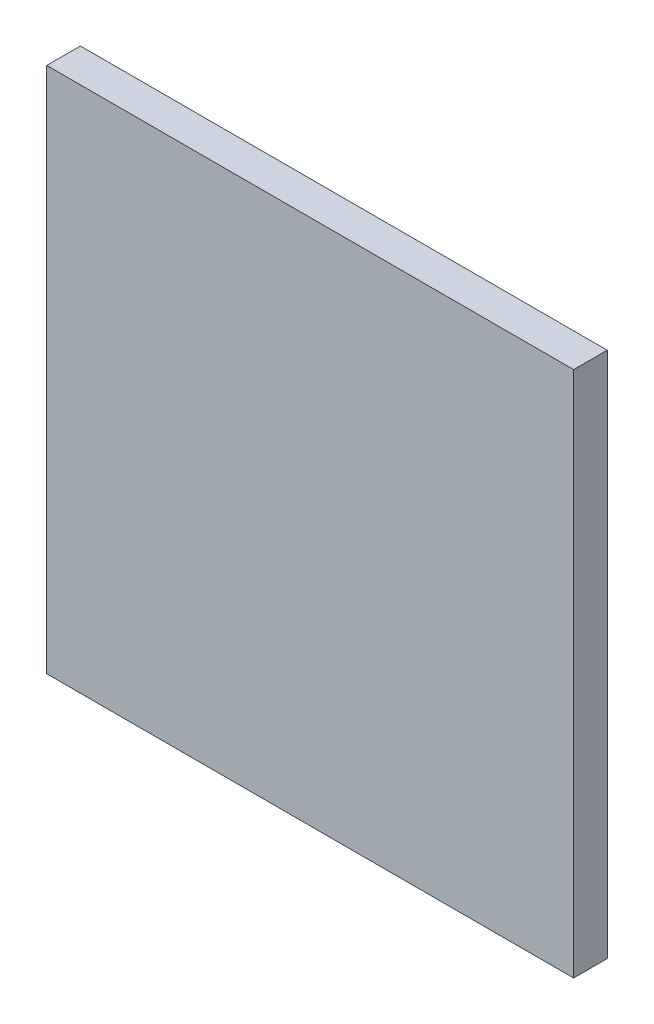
from build123d import *

# Parameters (mm, degrees)
ESQUISSE1_W        = 47
ESQUISSE1_H        = 47
BOSS_EXTRU_1_DEPTH = 3


with BuildPart() as part:
    # Esquisse1 → Boss.-Extru.1 (new body)
    with BuildSketch(Plane.XY):
        Rectangle(ESQUISSE1_W, ESQUISSE1_H)
    extrude(amount=BOSS_EXTRU_1_DEPTH)


solid = part.part
